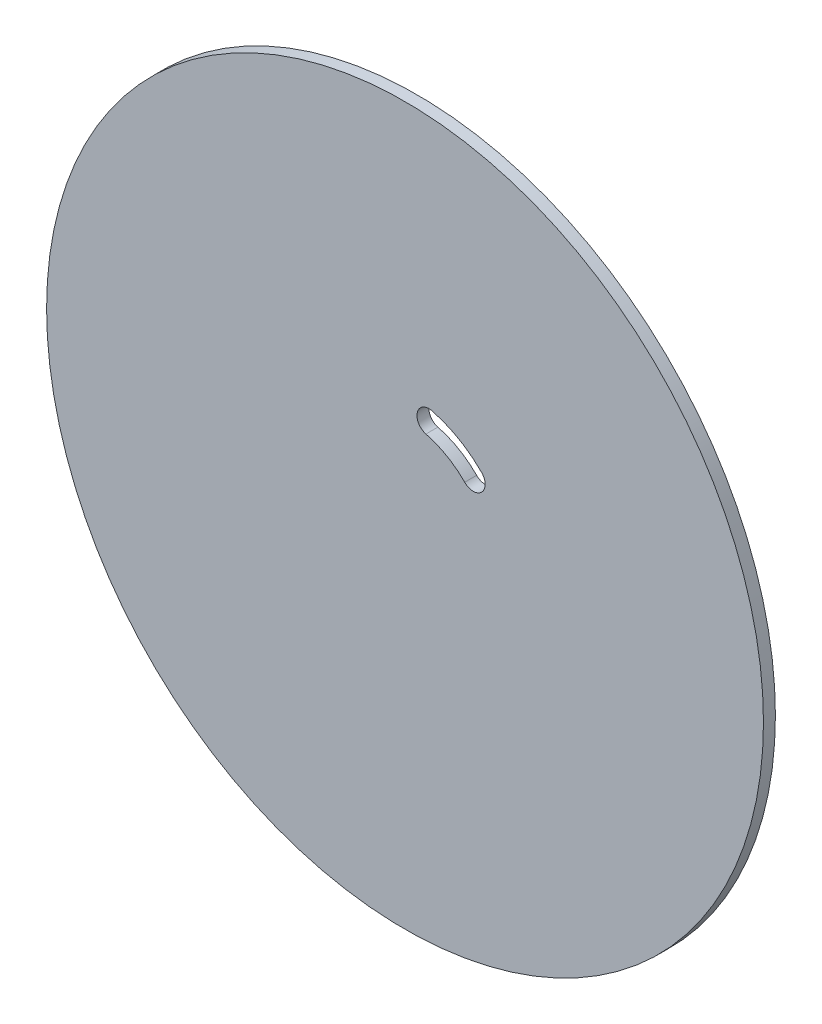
from build123d import *

# Parameters (mm, degrees)
SKETCH1_R          = 190.5
EXTRUDE1_DEPTH     = 6.35
CUT_EXTRUDE1_DEPTH = 270.482508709


with BuildPart() as part:
    # Sketch1 → Extrude1 (new body)
    with BuildSketch(Plane.XY):
        Circle(SKETCH1_R)
    extrude(amount=EXTRUDE1_DEPTH)

    # Sketch2 → Cut-Extrude1 (cut, through all)
    with BuildSketch(Plane.XY.offset(6.35)):
        with BuildLine():
            ThreePointArc((11.1125, 43.038527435), (22.225, 38.494829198), (31.7162081, 31.142971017))
            ThreePointArc((31.7162081, 31.142971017), (40.696090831, 31.061080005), (40.777981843, 40.040962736))
            ThreePointArc((40.777981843, 40.040962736), (28.575, 49.493351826), (14.2875, 55.335249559))
            ThreePointArc((14.2875, 55.335249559), (6.551638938, 50.774388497), (11.1125, 43.038527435))
        make_face()
    extrude(amount=-CUT_EXTRUDE1_DEPTH, mode=Mode.SUBTRACT)


solid = part.part
